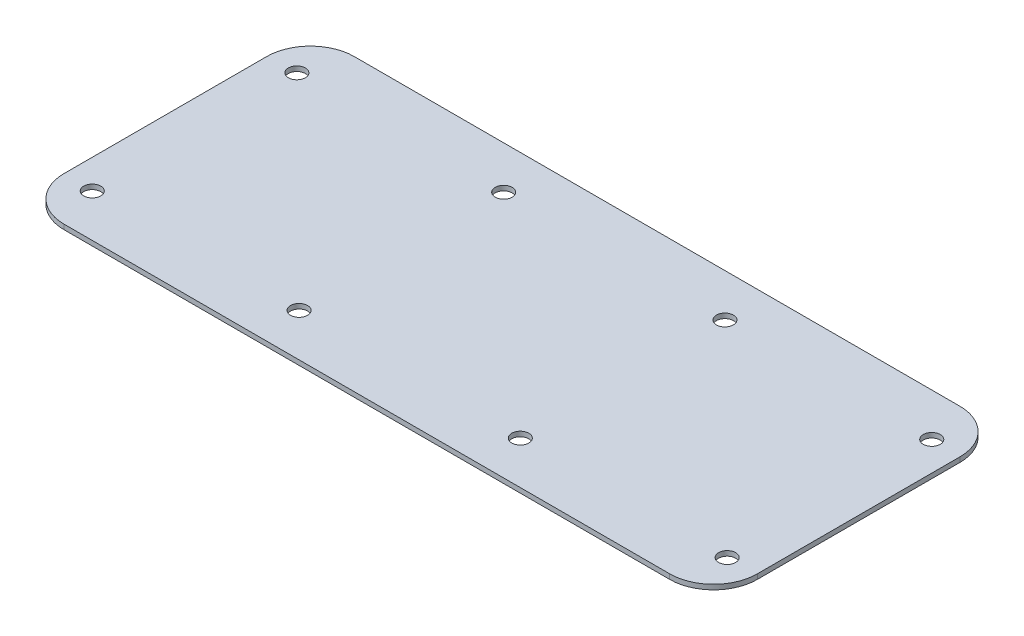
from build123d import *

# Parameters (mm, degrees)
SKETCH4_W           = 1923.192676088
SKETCH4_H           = 989.965782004
MAIN_PLATE_DEPTH    = 12.7
FILLET1_R           = 139.7
SKETCH9_W           = 2062.312122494
SKETCH9_H           = 1194.135134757
CUT_EXTRUDE4_DEPTH  = 25.4
SKETCH10_W          = 2432.065150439
SKETCH10_H          = 1347.148138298
CUT_EXTRUDE5_DEPTH  = 1599.790413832
SKETCH23_R          = 26.19375
CUT_EXTRUDE12_DEPTH = 1583.803876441
SKETCH24_W          = 2101.466679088
SKETCH24_H          = 1121.812359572
CUT_EXTRUDE13_DEPTH = 1583.803876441
SKETCH25_R          = 31.75
SKETCH25_R_2        = 22.225
BOSS_EXTRUDE2_DEPTH = 12.7


with BuildPart() as part:
    # Sketch4 → main plate (new body)
    with BuildSketch(Plane(origin=(0, 0, 0), x_dir=(1, 0, 0), z_dir=(0, 1, 0))):
        with Locations((558.588333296, 0)):
            Rectangle(SKETCH4_W, SKETCH4_H)
    extrude(amount=MAIN_PLATE_DEPTH)

    # Fillet1
    fillet1_edges = [part.edges().sort_by_distance(p)[0] for p in [
        (-403.008004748, 6.35, -494.982891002),
        (1520.18467134, 6.35, -494.982891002),
        (1520.18467134, 6.35, 494.982891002),
        (-403.008004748, 6.35, 494.982891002),
    ]]
    fillet(fillet1_edges, radius=FILLET1_R)

    # Sketch9 → Cut-Extrude4 (cut)
    with BuildSketch(Plane(origin=(0, 0, 0), x_dir=(1, 0, 0), z_dir=(0, 1, 0))):
        with Locations((565.395140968, -8.644692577)):
            Rectangle(SKETCH9_W, SKETCH9_H)
        with BuildLine():
            Line((-403.008004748, 368.667884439), (-403.008004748, -368.667884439))
            ThreePointArc((-403.008004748, -368.667884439), (-376.969797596, -431.529677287), (-314.108004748, -457.567884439))
            Line((-314.108004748, -457.567884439), (-108.167567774, -457.567884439))
            ThreePointArc((-108.167567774, -457.567884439), (-83.867169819, -462.401534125), (-63.266287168, -476.166603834))
            Line((-63.266287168, -476.166603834), (-63.048719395, -476.384171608))
            ThreePointArc((-63.048719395, -476.384171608), (-42.447836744, -490.149241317), (-18.147438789, -494.982891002))
            Line((-18.147438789, -494.982891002), (1135.324105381, -494.982891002))
            ThreePointArc((1135.324105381, -494.982891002), (1159.624503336, -490.149241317), (1180.225385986, -476.384171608))
            Line((1180.225385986, -476.384171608), (1180.44295376, -476.166603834))
            ThreePointArc((1180.44295376, -476.166603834), (1201.04383641, -462.401534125), (1225.344234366, -457.567884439))
            Line((1225.344234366, -457.567884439), (1431.28467134, -457.567884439))
            ThreePointArc((1431.28467134, -457.567884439), (1494.146464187, -431.529677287), (1520.18467134, -368.667884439))
            Line((1520.18467134, -368.667884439), (1520.18467134, 368.667884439))
            ThreePointArc((1520.18467134, 368.667884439), (1494.146464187, 431.529677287), (1431.28467134, 457.567884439))
            Line((1431.28467134, 457.567884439), (1225.344234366, 457.567884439))
            ThreePointArc((1225.344234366, 457.567884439), (1201.04383641, 462.401534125), (1180.44295376, 476.166603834))
            Line((1180.44295376, 476.166603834), (1180.225385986, 476.384171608))
            ThreePointArc((1180.225385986, 476.384171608), (1159.624503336, 490.149241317), (1135.324105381, 494.982891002))
            Line((1135.324105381, 494.982891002), (-18.147438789, 494.982891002))
            ThreePointArc((-18.147438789, 494.982891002), (-42.447836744, 490.149241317), (-63.048719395, 476.384171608))
            Line((-63.048719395, 476.384171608), (-63.266287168, 476.166603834))
            ThreePointArc((-63.266287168, 476.166603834), (-83.867169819, 462.401534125), (-108.167567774, 457.567884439))
            Line((-108.167567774, 457.567884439), (-314.108004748, 457.567884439))
            ThreePointArc((-314.108004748, 457.567884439), (-376.969797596, 431.529677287), (-403.008004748, 368.667884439))
        make_face(mode=Mode.SUBTRACT)
    extrude(amount=CUT_EXTRUDE4_DEPTH, mode=Mode.SUBTRACT)

    # Sketch10 → Cut-Extrude5 (cut, through all)
    with BuildSketch(Plane(origin=(0, 0, 0), x_dir=(1, 0, 0), z_dir=(0, 1, 0))):
        with Locations((571.442800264, -57.845101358)):
            Rectangle(SKETCH10_W, SKETCH10_H)
        with BuildLine():
            Line((1225.344234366, -444.867884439), (1431.28467134, -444.867884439))
            ThreePointArc((1431.28467134, -444.867884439), (1467.106144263, -435.923085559), (1494.517751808, -411.188673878))
            ThreePointArc((1494.517751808, -411.188673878), (1504.20047716, -383.977827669), (1507.48467134, -355.282891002))
            Line((1507.48467134, -355.282891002), (1507.48467134, 355.282891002))
            ThreePointArc((1507.48467134, 355.282891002), (1504.20047716, 383.977827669), (1494.517751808, 411.188673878))
            ThreePointArc((1494.517751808, 411.188673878), (1467.106144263, 435.923085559), (1431.28467134, 444.867884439))
            Line((1431.28467134, 444.867884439), (1225.344234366, 444.867884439))
            ThreePointArc((1225.344234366, 444.867884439), (1196.183756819, 450.668264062), (1171.462697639, 467.186347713))
            Line((1171.462697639, 467.186347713), (1171.245129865, 467.403915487))
            ThreePointArc((1171.245129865, 467.403915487), (1154.764423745, 478.415971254), (1135.324105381, 482.282891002))
            Line((1135.324105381, 482.282891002), (-18.147438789, 482.282891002))
            ThreePointArc((-18.147438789, 482.282891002), (-37.587757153, 478.415971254), (-54.068463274, 467.403915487))
            Line((-54.068463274, 467.403915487), (-54.286031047, 467.186347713))
            ThreePointArc((-54.286031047, 467.186347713), (-79.007090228, 450.668264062), (-108.167567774, 444.867884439))
            Line((-108.167567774, 444.867884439), (-314.108004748, 444.867884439))
            ThreePointArc((-314.108004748, 444.867884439), (-349.929477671, 435.923085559), (-377.341085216, 411.188673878))
            ThreePointArc((-377.341085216, 411.188673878), (-387.023810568, 383.977827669), (-390.308004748, 355.282891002))
            Line((-390.308004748, 355.282891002), (-390.308004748, -355.282891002))
            ThreePointArc((-390.308004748, -355.282891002), (-387.023810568, -383.977827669), (-377.341085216, -411.188673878))
            ThreePointArc((-377.341085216, -411.188673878), (-349.929477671, -435.923085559), (-314.108004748, -444.867884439))
            Line((-314.108004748, -444.867884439), (-108.167567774, -444.867884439))
            ThreePointArc((-108.167567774, -444.867884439), (-79.007090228, -450.668264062), (-54.286031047, -467.186347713))
            Line((-54.286031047, -467.186347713), (-54.068463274, -467.403915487))
            ThreePointArc((-54.068463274, -467.403915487), (-37.587757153, -478.415971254), (-18.147438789, -482.282891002))
            Line((-18.147438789, -482.282891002), (1135.324105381, -482.282891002))
            ThreePointArc((1135.324105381, -482.282891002), (1154.764423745, -478.415971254), (1171.245129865, -467.403915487))
            Line((1171.245129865, -467.403915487), (1171.462697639, -467.186347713))
            ThreePointArc((1171.462697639, -467.186347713), (1196.183756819, -450.668264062), (1225.344234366, -444.867884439))
        make_face(mode=Mode.SUBTRACT)
    extrude(amount=CUT_EXTRUDE5_DEPTH, mode=Mode.SUBTRACT)

    # Sketch23 → Cut-Extrude12 (cut, through all)
    with BuildSketch(Plane(origin=(0, 0, 0), x_dir=(1, 0, 0), z_dir=(0, 1, 0))):
        with Locations(Location((-269.922207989, 267.001207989, 0), (0, 0, 270))):
            Circle(SKETCH23_R)
        with Locations(Location((269.922207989, 267.001207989, 0), (0, 0, 270))):
            Circle(SKETCH23_R)
        with Locations(Location((269.922207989, -267.001207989, 0), (0, 0, 270))):
            Circle(SKETCH23_R)
        with Locations(Location((-269.922207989, -267.001207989, 0), (0, 0, 270))):
            Circle(SKETCH23_R)
        with Locations(Location((847.254458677, 267.001207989, 0), (0, 0, 270))):
            Circle(SKETCH23_R)
        with Locations(Location((1387.098874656, 267.001207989, 0), (0, 0, 270))):
            Circle(SKETCH23_R)
        with Locations(Location((1387.098874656, -267.001207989, 0), (0, 0, 270))):
            Circle(SKETCH23_R)
        with Locations(Location((847.254458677, -267.001207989, 0), (0, 0, 270))):
            Circle(SKETCH23_R)
    extrude(amount=CUT_EXTRUDE12_DEPTH, mode=Mode.SUBTRACT)

    # Sketch24 → Cut-Extrude13 (cut, through all)
    with BuildSketch(Plane(origin=(0, 0, 0), x_dir=(1, 0, 0), z_dir=(0, 1, 0))):
        with Locations((585.479744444, 7.315782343)):
            Rectangle(SKETCH24_W, SKETCH24_H)
        with BuildLine():
            Line((-231.822207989, 378.761207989), (1348.998874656, 378.761207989))
            ThreePointArc((1348.998874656, 378.761207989), (1429.821179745, 345.283513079), (1463.298874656, 264.461207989))
            Line((1463.298874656, 264.461207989), (1463.298874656, -264.461207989))
            ThreePointArc((1463.298874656, -264.461207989), (1429.821179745, -345.283513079), (1348.998874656, -378.761207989))
            Line((1348.998874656, -378.761207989), (-231.822207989, -378.761207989))
            ThreePointArc((-231.822207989, -378.761207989), (-312.644513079, -345.283513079), (-346.122207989, -264.461207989))
            Line((-346.122207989, -264.461207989), (-346.122207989, 264.461207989))
            ThreePointArc((-346.122207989, 264.461207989), (-312.644513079, 345.283513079), (-231.822207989, 378.761207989))
        make_face(mode=Mode.SUBTRACT)
    extrude(amount=CUT_EXTRUDE13_DEPTH, mode=Mode.SUBTRACT)

    # Sketch25 → Boss-Extrude2 (add)
    # profile 1 of 8: a face of its own
    with BuildSketch(Plane(origin=(0, 0, 0), x_dir=(1, 0, 0), z_dir=(0, 1, 0))):
        with Locations((-269.922207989, 267.001207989)):
            Circle(SKETCH25_R)
        with Locations(Location((-269.922207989, 267.001207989, 0), (0, 0, 90))):
            Circle(SKETCH25_R_2, mode=Mode.SUBTRACT)
    # profile 2 of 8: a face of its own
    with BuildSketch(Plane(origin=(0, 0, 0), x_dir=(1, 0, 0), z_dir=(0, 1, 0))):
        with Locations((269.922207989, 267.001207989)):
            Circle(SKETCH25_R)
        with Locations(Location((269.922207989, 267.001207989, 0), (0, 0, 90))):
            Circle(SKETCH25_R_2, mode=Mode.SUBTRACT)
    # profile 3 of 8: a face of its own
    with BuildSketch(Plane(origin=(0, 0, 0), x_dir=(1, 0, 0), z_dir=(0, 1, 0))):
        with Locations((847.254458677, 267.001207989)):
            Circle(SKETCH25_R)
        with Locations(Location((847.254458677, 267.001207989, 0), (0, 0, 90))):
            Circle(SKETCH25_R_2, mode=Mode.SUBTRACT)
    # profile 4 of 8: a face of its own
    with BuildSketch(Plane(origin=(0, 0, 0), x_dir=(1, 0, 0), z_dir=(0, 1, 0))):
        with Locations((1387.098874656, 267.001207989)):
            Circle(SKETCH25_R)
        with Locations(Location((1387.098874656, 267.001207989, 0), (0, 0, 90))):
            Circle(SKETCH25_R_2, mode=Mode.SUBTRACT)
    # profile 5 of 8: a face of its own
    with BuildSketch(Plane(origin=(0, 0, 0), x_dir=(1, 0, 0), z_dir=(0, 1, 0))):
        with Locations((-269.922207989, -267.001207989)):
            Circle(SKETCH25_R)
        with Locations(Location((-269.922207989, -267.001207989, 0), (0, 0, 90))):
            Circle(SKETCH25_R_2, mode=Mode.SUBTRACT)
    # profile 6 of 8: a face of its own
    with BuildSketch(Plane(origin=(0, 0, 0), x_dir=(1, 0, 0), z_dir=(0, 1, 0))):
        with Locations((269.922207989, -267.001207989)):
            Circle(SKETCH25_R)
        with Locations(Location((269.922207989, -267.001207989, 0), (0, 0, 90))):
            Circle(SKETCH25_R_2, mode=Mode.SUBTRACT)
    # profile 7 of 8: a face of its own
    with BuildSketch(Plane(origin=(0, 0, 0), x_dir=(1, 0, 0), z_dir=(0, 1, 0))):
        with Locations((847.254458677, -267.001207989)):
            Circle(SKETCH25_R)
        with Locations(Location((847.254458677, -267.001207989, 0), (0, 0, 90))):
            Circle(SKETCH25_R_2, mode=Mode.SUBTRACT)
    # profile 8 of 8: a face of its own
    with BuildSketch(Plane(origin=(0, 0, 0), x_dir=(1, 0, 0), z_dir=(0, 1, 0))):
        with Locations((1387.098874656, -267.001207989)):
            Circle(SKETCH25_R)
        with Locations(Location((1387.098874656, -267.001207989, 0), (0, 0, 90))):
            Circle(SKETCH25_R_2, mode=Mode.SUBTRACT)
    extrude(amount=BOSS_EXTRUDE2_DEPTH)


solid = part.part
